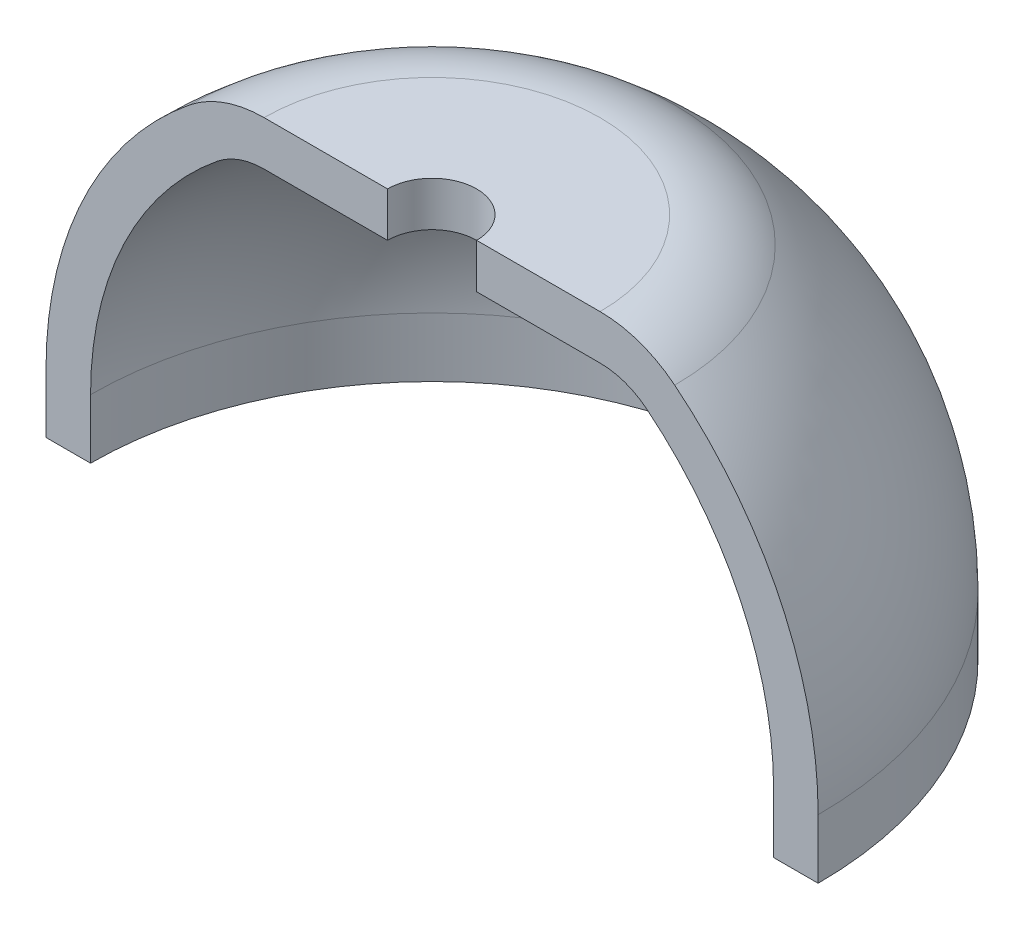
ISO-10303-21;
HEADER;
FILE_DESCRIPTION(('STEP AP214'),'2;1');
FILE_NAME('part.step','',(''),(''),'','','');
FILE_SCHEMA(('AUTOMOTIVE_DESIGN { 1 0 10303 214 1 1 1 1 }'));
ENDSEC;
DATA;
#1=APPLICATION_CONTEXT('core data for automotive mechanical design processes');
#2=APPLICATION_PROTOCOL_DEFINITION('international standard','automotive_design',2000,#1);
#3=PRODUCT_CONTEXT('',#1,'mechanical');
#4=PRODUCT('Part','Part','',(#3));
#5=PRODUCT_RELATED_PRODUCT_CATEGORY('part','',(#4));
#6=PRODUCT_DEFINITION_FORMATION('','',#4);
#7=PRODUCT_DEFINITION_CONTEXT('part definition',#1,'design');
#8=PRODUCT_DEFINITION('design','',#6,#7);
#9=PRODUCT_DEFINITION_SHAPE('','',#8);
#10=(LENGTH_UNIT() NAMED_UNIT(*) SI_UNIT(.MILLI.,.METRE.));
#11=(NAMED_UNIT(*) PLANE_ANGLE_UNIT() SI_UNIT($,.RADIAN.));
#12=(NAMED_UNIT(*) SI_UNIT($,.STERADIAN.) SOLID_ANGLE_UNIT());
#13=UNCERTAINTY_MEASURE_WITH_UNIT(LENGTH_MEASURE(1.E-05),#10,'distance_accuracy_value','');
#14=(GEOMETRIC_REPRESENTATION_CONTEXT(3) GLOBAL_UNCERTAINTY_ASSIGNED_CONTEXT((#13)) GLOBAL_UNIT_ASSIGNED_CONTEXT((#10,
#11,#12)) REPRESENTATION_CONTEXT('',''));
#15=CARTESIAN_POINT('',(0.,0.,0.));
#16=DIRECTION('',(0.,0.,1.));
#17=DIRECTION('',(1.,0.,0.));
#18=AXIS2_PLACEMENT_3D('',#15,#16,#17);
#19=CARTESIAN_POINT('',(0.,0.,0.));
#20=DIRECTION('',(0.,1.,0.));
#21=DIRECTION('',(1.,0.,0.));
#22=AXIS2_PLACEMENT_3D('',#19,#20,#21);
#23=SPHERICAL_SURFACE('',#22,13.);
#24=CARTESIAN_POINT('',(0.,0.,0.));
#25=DIRECTION('',(0.,1.,0.));
#26=DIRECTION('',(-1.,0.,0.));
#27=AXIS2_PLACEMENT_3D('',#24,#25,#26);
#28=CIRCLE('',#27,13.);
#29=CARTESIAN_POINT('',(13.,0.,0.));
#30=VERTEX_POINT('',#29);
#31=CARTESIAN_POINT('',(-13.,0.,0.));
#32=VERTEX_POINT('',#31);
#33=EDGE_CURVE('E183',#30,#32,#28,.T.);
#34=ORIENTED_EDGE('',*,*,#33,.T.);
#35=CARTESIAN_POINT('',(0.,0.,0.));
#36=DIRECTION('',(0.,0.,-1.));
#37=DIRECTION('',(-1.,0.,0.));
#38=AXIS2_PLACEMENT_3D('',#35,#36,#37);
#39=CIRCLE('',#38,13.);
#40=CARTESIAN_POINT('',(-8.17101169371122,10.1111111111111,0.));
#41=VERTEX_POINT('',#40);
#42=EDGE_CURVE('E176',#32,#41,#39,.T.);
#43=ORIENTED_EDGE('',*,*,#42,.T.);
#44=CARTESIAN_POINT('',(0.,10.1111111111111,0.));
#45=DIRECTION('',(0.,1.,0.));
#46=DIRECTION('',(-1.,0.,0.));
#47=AXIS2_PLACEMENT_3D('',#44,#45,#46);
#48=CIRCLE('',#47,8.17101169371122);
#49=CARTESIAN_POINT('',(8.17101169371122,10.1111111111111,0.));
#50=VERTEX_POINT('',#49);
#51=EDGE_CURVE('E130',#50,#41,#48,.T.);
#52=ORIENTED_EDGE('',*,*,#51,.F.);
#53=EDGE_CURVE('E109',#50,#30,#39,.T.);
#54=ORIENTED_EDGE('',*,*,#53,.T.);
#55=EDGE_LOOP('',(#34,#43,#52,#54));
#56=FACE_BOUND('',#55,.T.);
#57=ADVANCED_FACE('F33',(#56),#23,.T.);
#58=CARTESIAN_POINT('',(0.,7.,0.));
#59=DIRECTION('',(0.,1.,0.));
#60=DIRECTION('',(-1.,0.,0.));
#61=AXIS2_PLACEMENT_3D('',#58,#59,#60);
#62=TOROIDAL_SURFACE('',#61,5.65685424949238,4.);
#63=ORIENTED_EDGE('',*,*,#51,.T.);
#64=CARTESIAN_POINT('',(-5.65685424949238,7.,0.));
#65=DIRECTION('',(0.,0.,-1.));
#66=DIRECTION('',(-1.,0.,0.));
#67=AXIS2_PLACEMENT_3D('',#64,#65,#66);
#68=CIRCLE('',#67,4.);
#69=CARTESIAN_POINT('',(-5.65685424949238,11.,0.));
#70=VERTEX_POINT('',#69);
#71=EDGE_CURVE('E129',#41,#70,#68,.T.);
#72=ORIENTED_EDGE('',*,*,#71,.T.);
#73=CARTESIAN_POINT('',(0.,11.,0.));
#74=DIRECTION('',(0.,1.,0.));
#75=DIRECTION('',(-1.,0.,0.));
#76=AXIS2_PLACEMENT_3D('',#73,#74,#75);
#77=CIRCLE('',#76,5.65685424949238);
#78=CARTESIAN_POINT('',(5.65685424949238,11.,0.));
#79=VERTEX_POINT('',#78);
#80=EDGE_CURVE('E121',#79,#70,#77,.T.);
#81=ORIENTED_EDGE('',*,*,#80,.F.);
#82=CARTESIAN_POINT('',(5.65685424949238,7.,0.));
#83=DIRECTION('',(0.,0.,-1.));
#84=DIRECTION('',(-1.,0.,0.));
#85=AXIS2_PLACEMENT_3D('',#82,#83,#84);
#86=CIRCLE('',#85,4.);
#87=EDGE_CURVE('E106',#79,#50,#86,.T.);
#88=ORIENTED_EDGE('',*,*,#87,.T.);
#89=EDGE_LOOP('',(#63,#72,#81,#88));
#90=FACE_BOUND('',#89,.T.);
#91=ADVANCED_FACE('F128',(#90),#62,.T.);
#92=CARTESIAN_POINT('',(0.,11.,0.));
#93=DIRECTION('',(0.,-1.,0.));
#94=DIRECTION('',(1.,0.,0.));
#95=AXIS2_PLACEMENT_3D('',#92,#93,#94);
#96=PLANE('',#95);
#97=ORIENTED_EDGE('',*,*,#80,.T.);
#98=DIRECTION('',(-1.,0.,0.));
#99=VECTOR('',#98,1.);
#100=CARTESIAN_POINT('',(-17.8355130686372,11.,0.));
#101=LINE('',#100,#99);
#102=CARTESIAN_POINT('',(-1.5,11.,0.));
#103=VERTEX_POINT('',#102);
#104=EDGE_CURVE('E125',#103,#70,#101,.T.);
#105=ORIENTED_EDGE('',*,*,#104,.F.);
#106=CARTESIAN_POINT('',(0.,11.,0.));
#107=DIRECTION('',(0.,1.,0.));
#108=DIRECTION('',(-1.,0.,0.));
#109=AXIS2_PLACEMENT_3D('',#106,#107,#108);
#110=CIRCLE('',#109,1.5);
#111=CARTESIAN_POINT('',(1.5,11.,0.));
#112=VERTEX_POINT('',#111);
#113=EDGE_CURVE('E123',#112,#103,#110,.T.);
#114=ORIENTED_EDGE('',*,*,#113,.F.);
#115=EDGE_CURVE('E54',#79,#112,#101,.T.);
#116=ORIENTED_EDGE('',*,*,#115,.F.);
#117=EDGE_LOOP('',(#97,#105,#114,#116));
#118=FACE_BOUND('',#117,.T.);
#119=ADVANCED_FACE('F119',(#118),#96,.F.);
#120=CARTESIAN_POINT('',(0.,9.5,0.));
#121=DIRECTION('',(0.,1.,0.));
#122=DIRECTION('',(-1.,0.,0.));
#123=AXIS2_PLACEMENT_3D('',#120,#121,#122);
#124=PLANE('',#123);
#125=CARTESIAN_POINT('',(0.,9.5,0.));
#126=DIRECTION('',(0.,1.,0.));
#127=DIRECTION('',(-1.,0.,0.));
#128=AXIS2_PLACEMENT_3D('',#125,#126,#127);
#129=CIRCLE('',#128,5.65685424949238);
#130=CARTESIAN_POINT('',(5.65685424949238,9.5,0.));
#131=VERTEX_POINT('',#130);
#132=CARTESIAN_POINT('',(-5.65685424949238,9.5,0.));
#133=VERTEX_POINT('',#132);
#134=EDGE_CURVE('E131',#131,#133,#129,.T.);
#135=ORIENTED_EDGE('',*,*,#134,.F.);
#136=DIRECTION('',(-1.,0.,0.));
#137=VECTOR('',#136,1.);
#138=CARTESIAN_POINT('',(0.,9.5,0.));
#139=LINE('',#138,#137);
#140=CARTESIAN_POINT('',(1.5,9.5,0.));
#141=VERTEX_POINT('',#140);
#142=EDGE_CURVE('E144',#131,#141,#139,.T.);
#143=ORIENTED_EDGE('',*,*,#142,.T.);
#144=CARTESIAN_POINT('',(0.,9.5,0.));
#145=DIRECTION('',(0.,1.,0.));
#146=DIRECTION('',(-1.,0.,0.));
#147=AXIS2_PLACEMENT_3D('',#144,#145,#146);
#148=CIRCLE('',#147,1.5);
#149=CARTESIAN_POINT('',(-1.5,9.5,0.));
#150=VERTEX_POINT('',#149);
#151=EDGE_CURVE('E142',#150,#141,#148,.F.);
#152=ORIENTED_EDGE('',*,*,#151,.F.);
#153=EDGE_CURVE('E47',#150,#133,#139,.T.);
#154=ORIENTED_EDGE('',*,*,#153,.T.);
#155=EDGE_LOOP('',(#135,#143,#152,#154));
#156=FACE_BOUND('',#155,.T.);
#157=ADVANCED_FACE('F148',(#156),#124,.F.);
#158=CARTESIAN_POINT('',(0.,7.,0.));
#159=DIRECTION('',(0.,1.,0.));
#160=DIRECTION('',(-1.,0.,0.));
#161=AXIS2_PLACEMENT_3D('',#158,#159,#160);
#162=TOROIDAL_SURFACE('',#161,5.65685424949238,2.5);
#163=ORIENTED_EDGE('',*,*,#134,.T.);
#164=CARTESIAN_POINT('',(-5.65685424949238,7.,0.));
#165=DIRECTION('',(0.,0.,-1.));
#166=DIRECTION('',(-1.,0.,0.));
#167=AXIS2_PLACEMENT_3D('',#164,#165,#166);
#168=CIRCLE('',#167,2.5);
#169=CARTESIAN_POINT('',(-7.22820265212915,8.94444444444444,0.));
#170=VERTEX_POINT('',#169);
#171=EDGE_CURVE('E156',#133,#170,#168,.F.);
#172=ORIENTED_EDGE('',*,*,#171,.T.);
#173=CARTESIAN_POINT('',(0.,8.94444444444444,0.));
#174=DIRECTION('',(0.,1.,0.));
#175=DIRECTION('',(-1.,0.,0.));
#176=AXIS2_PLACEMENT_3D('',#173,#174,#175);
#177=CIRCLE('',#176,7.22820265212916);
#178=CARTESIAN_POINT('',(7.22820265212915,8.94444444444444,0.));
#179=VERTEX_POINT('',#178);
#180=EDGE_CURVE('E135',#179,#170,#177,.T.);
#181=ORIENTED_EDGE('',*,*,#180,.F.);
#182=CARTESIAN_POINT('',(5.65685424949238,7.,0.));
#183=DIRECTION('',(0.,0.,-1.));
#184=DIRECTION('',(-1.,0.,0.));
#185=AXIS2_PLACEMENT_3D('',#182,#183,#184);
#186=CIRCLE('',#185,2.5);
#187=EDGE_CURVE('E149',#179,#131,#186,.F.);
#188=ORIENTED_EDGE('',*,*,#187,.T.);
#189=EDGE_LOOP('',(#163,#172,#181,#188));
#190=FACE_BOUND('',#189,.T.);
#191=ADVANCED_FACE('F199',(#190),#162,.F.);
#192=CARTESIAN_POINT('',(0.,0.,0.));
#193=DIRECTION('',(0.,1.,0.));
#194=DIRECTION('',(1.,0.,0.));
#195=AXIS2_PLACEMENT_3D('',#192,#193,#194);
#196=SPHERICAL_SURFACE('',#195,11.5);
#197=CARTESIAN_POINT('',(0.,0.,0.));
#198=DIRECTION('',(0.,1.,0.));
#199=DIRECTION('',(-1.,0.,0.));
#200=AXIS2_PLACEMENT_3D('',#197,#198,#199);
#201=CIRCLE('',#200,11.5);
#202=CARTESIAN_POINT('',(11.5,0.,0.));
#203=VERTEX_POINT('',#202);
#204=CARTESIAN_POINT('',(-11.5,0.,0.));
#205=VERTEX_POINT('',#204);
#206=EDGE_CURVE('E192',#203,#205,#201,.T.);
#207=ORIENTED_EDGE('',*,*,#206,.F.);
#208=CARTESIAN_POINT('',(0.,0.,0.));
#209=DIRECTION('',(0.,0.,-1.));
#210=DIRECTION('',(-1.,0.,0.));
#211=AXIS2_PLACEMENT_3D('',#208,#209,#210);
#212=CIRCLE('',#211,11.5);
#213=EDGE_CURVE('E152',#203,#179,#212,.F.);
#214=ORIENTED_EDGE('',*,*,#213,.T.);
#215=ORIENTED_EDGE('',*,*,#180,.T.);
#216=EDGE_CURVE('E159',#170,#205,#212,.F.);
#217=ORIENTED_EDGE('',*,*,#216,.T.);
#218=EDGE_LOOP('',(#207,#214,#215,#217));
#219=FACE_BOUND('',#218,.T.);
#220=ADVANCED_FACE('F197',(#219),#196,.F.);
#221=CARTESIAN_POINT('',(0.,9.5,0.));
#222=DIRECTION('',(0.,1.,0.));
#223=DIRECTION('',(-1.,0.,0.));
#224=AXIS2_PLACEMENT_3D('',#221,#222,#223);
#225=CYLINDRICAL_SURFACE('',#224,11.5);
#226=ORIENTED_EDGE('',*,*,#206,.T.);
#227=DIRECTION('',(0.,1.,0.));
#228=VECTOR('',#227,1.);
#229=CARTESIAN_POINT('',(-11.5,9.5,0.));
#230=LINE('',#229,#228);
#231=CARTESIAN_POINT('',(-11.5,-2.,0.));
#232=VERTEX_POINT('',#231);
#233=EDGE_CURVE('E170',#205,#232,#230,.F.);
#234=ORIENTED_EDGE('',*,*,#233,.T.);
#235=CARTESIAN_POINT('',(0.,-2.,0.));
#236=DIRECTION('',(0.,1.,0.));
#237=DIRECTION('',(-1.,0.,0.));
#238=AXIS2_PLACEMENT_3D('',#235,#236,#237);
#239=CIRCLE('',#238,11.5);
#240=CARTESIAN_POINT('',(11.5,-2.,0.));
#241=VERTEX_POINT('',#240);
#242=EDGE_CURVE('E189',#241,#232,#239,.T.);
#243=ORIENTED_EDGE('',*,*,#242,.F.);
#244=DIRECTION('',(0.,1.,0.));
#245=VECTOR('',#244,1.);
#246=CARTESIAN_POINT('',(11.5,9.5,0.));
#247=LINE('',#246,#245);
#248=EDGE_CURVE('E157',#241,#203,#247,.T.);
#249=ORIENTED_EDGE('',*,*,#248,.T.);
#250=EDGE_LOOP('',(#226,#234,#243,#249));
#251=FACE_BOUND('',#250,.T.);
#252=ADVANCED_FACE('F202',(#251),#225,.F.);
#253=CARTESIAN_POINT('',(11.5,-2.,0.));
#254=DIRECTION('',(0.,1.,0.));
#255=DIRECTION('',(-1.,0.,0.));
#256=AXIS2_PLACEMENT_3D('',#253,#254,#255);
#257=PLANE('',#256);
#258=CARTESIAN_POINT('',(0.,-2.,0.));
#259=DIRECTION('',(0.,1.,0.));
#260=DIRECTION('',(-1.,0.,0.));
#261=AXIS2_PLACEMENT_3D('',#258,#259,#260);
#262=CIRCLE('',#261,13.);
#263=CARTESIAN_POINT('',(13.,-2.,0.));
#264=VERTEX_POINT('',#263);
#265=CARTESIAN_POINT('',(-13.,-2.,0.));
#266=VERTEX_POINT('',#265);
#267=EDGE_CURVE('E186',#264,#266,#262,.T.);
#268=ORIENTED_EDGE('',*,*,#267,.F.);
#269=DIRECTION('',(-1.,0.,0.));
#270=VECTOR('',#269,1.);
#271=CARTESIAN_POINT('',(-17.8355130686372,-2.,0.));
#272=LINE('',#271,#270);
#273=EDGE_CURVE('E150',#264,#241,#272,.T.);
#274=ORIENTED_EDGE('',*,*,#273,.T.);
#275=ORIENTED_EDGE('',*,*,#242,.T.);
#276=EDGE_CURVE('E124',#232,#266,#272,.T.);
#277=ORIENTED_EDGE('',*,*,#276,.T.);
#278=EDGE_LOOP('',(#268,#274,#275,#277));
#279=FACE_BOUND('',#278,.T.);
#280=ADVANCED_FACE('F205',(#279),#257,.F.);
#281=CARTESIAN_POINT('',(0.,9.5,0.));
#282=DIRECTION('',(0.,1.,0.));
#283=DIRECTION('',(-1.,0.,0.));
#284=AXIS2_PLACEMENT_3D('',#281,#282,#283);
#285=CYLINDRICAL_SURFACE('',#284,13.);
#286=ORIENTED_EDGE('',*,*,#267,.T.);
#287=DIRECTION('',(0.,1.,0.));
#288=VECTOR('',#287,1.);
#289=CARTESIAN_POINT('',(-13.,9.5,0.));
#290=LINE('',#289,#288);
#291=EDGE_CURVE('E114',#266,#32,#290,.T.);
#292=ORIENTED_EDGE('',*,*,#291,.T.);
#293=ORIENTED_EDGE('',*,*,#33,.F.);
#294=DIRECTION('',(0.,1.,0.));
#295=VECTOR('',#294,1.);
#296=CARTESIAN_POINT('',(13.,9.5,0.));
#297=LINE('',#296,#295);
#298=EDGE_CURVE('E173',#30,#264,#297,.F.);
#299=ORIENTED_EDGE('',*,*,#298,.T.);
#300=EDGE_LOOP('',(#286,#292,#293,#299));
#301=FACE_BOUND('',#300,.T.);
#302=ADVANCED_FACE('F208',(#301),#285,.T.);
#303=CARTESIAN_POINT('',(0.,-2.001,0.));
#304=DIRECTION('',(0.,1.,0.));
#305=DIRECTION('',(-1.,0.,0.));
#306=AXIS2_PLACEMENT_3D('',#303,#304,#305);
#307=CYLINDRICAL_SURFACE('',#306,1.5);
#308=ORIENTED_EDGE('',*,*,#113,.T.);
#309=DIRECTION('',(0.,1.,0.));
#310=VECTOR('',#309,1.);
#311=CARTESIAN_POINT('',(-1.5,-2.001,0.));
#312=LINE('',#311,#310);
#313=EDGE_CURVE('E11',#103,#150,#312,.F.);
#314=ORIENTED_EDGE('',*,*,#313,.T.);
#315=ORIENTED_EDGE('',*,*,#151,.T.);
#316=DIRECTION('',(0.,1.,0.));
#317=VECTOR('',#316,1.);
#318=CARTESIAN_POINT('',(1.5,-2.001,0.));
#319=LINE('',#318,#317);
#320=EDGE_CURVE('E40',#141,#112,#319,.T.);
#321=ORIENTED_EDGE('',*,*,#320,.T.);
#322=EDGE_LOOP('',(#308,#314,#315,#321));
#323=FACE_BOUND('',#322,.T.);
#324=ADVANCED_FACE('F140',(#323),#307,.F.);
#325=CARTESIAN_POINT('',(-17.8355130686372,-2.,0.));
#326=DIRECTION('',(0.,0.,-1.));
#327=DIRECTION('',(-1.,0.,0.));
#328=AXIS2_PLACEMENT_3D('',#325,#326,#327);
#329=PLANE('',#328);
#330=ORIENTED_EDGE('',*,*,#115,.T.);
#331=ORIENTED_EDGE('',*,*,#320,.F.);
#332=ORIENTED_EDGE('',*,*,#142,.F.);
#333=ORIENTED_EDGE('',*,*,#187,.F.);
#334=ORIENTED_EDGE('',*,*,#213,.F.);
#335=ORIENTED_EDGE('',*,*,#248,.F.);
#336=ORIENTED_EDGE('',*,*,#273,.F.);
#337=ORIENTED_EDGE('',*,*,#298,.F.);
#338=ORIENTED_EDGE('',*,*,#53,.F.);
#339=ORIENTED_EDGE('',*,*,#87,.F.);
#340=EDGE_LOOP('',(#330,#331,#332,#333,#334,#335,#336,#337,#338,#339));
#341=FACE_BOUND('',#340,.T.);
#342=ADVANCED_FACE('F107',(#341),#329,.F.);
#343=ORIENTED_EDGE('',*,*,#42,.F.);
#344=ORIENTED_EDGE('',*,*,#291,.F.);
#345=ORIENTED_EDGE('',*,*,#276,.F.);
#346=ORIENTED_EDGE('',*,*,#233,.F.);
#347=ORIENTED_EDGE('',*,*,#216,.F.);
#348=ORIENTED_EDGE('',*,*,#171,.F.);
#349=ORIENTED_EDGE('',*,*,#153,.F.);
#350=ORIENTED_EDGE('',*,*,#313,.F.);
#351=ORIENTED_EDGE('',*,*,#104,.T.);
#352=ORIENTED_EDGE('',*,*,#71,.F.);
#353=EDGE_LOOP('',(#343,#344,#345,#346,#347,#348,#349,#350,#351,#352));
#354=FACE_BOUND('',#353,.T.);
#355=ADVANCED_FACE('F200',(#354),#329,.F.);
#356=CLOSED_SHELL('',(#57,#91,#119,#157,#191,#220,#252,#280,#302,#324,#342,#355));
#357=MANIFOLD_SOLID_BREP('B2',#356);
#358=ADVANCED_BREP_SHAPE_REPRESENTATION('',(#18,#357),#14);
#359=SHAPE_DEFINITION_REPRESENTATION(#9,#358);
ENDSEC;
END-ISO-10303-21;
